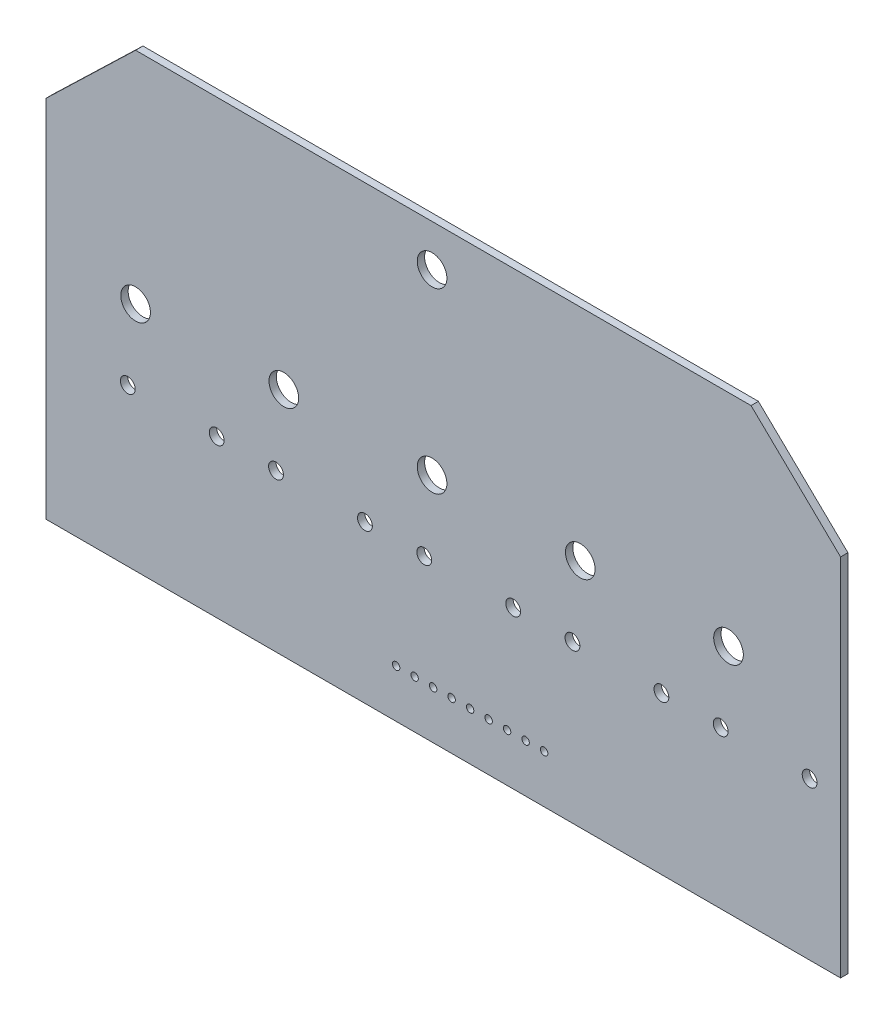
ISO-10303-21;
HEADER;
FILE_DESCRIPTION(('STEP AP214'),'2;1');
FILE_NAME('part.step','',(''),(''),'','','');
FILE_SCHEMA(('AUTOMOTIVE_DESIGN { 1 0 10303 214 1 1 1 1 }'));
ENDSEC;
DATA;
#1=APPLICATION_CONTEXT('core data for automotive mechanical design processes');
#2=APPLICATION_PROTOCOL_DEFINITION('international standard','automotive_design',2000,#1);
#3=PRODUCT_CONTEXT('',#1,'mechanical');
#4=PRODUCT('Part','Part','',(#3));
#5=PRODUCT_RELATED_PRODUCT_CATEGORY('part','',(#4));
#6=PRODUCT_DEFINITION_FORMATION('','',#4);
#7=PRODUCT_DEFINITION_CONTEXT('part definition',#1,'design');
#8=PRODUCT_DEFINITION('design','',#6,#7);
#9=PRODUCT_DEFINITION_SHAPE('','',#8);
#10=(LENGTH_UNIT() NAMED_UNIT(*) SI_UNIT(.MILLI.,.METRE.));
#11=(NAMED_UNIT(*) PLANE_ANGLE_UNIT() SI_UNIT($,.RADIAN.));
#12=(NAMED_UNIT(*) SI_UNIT($,.STERADIAN.) SOLID_ANGLE_UNIT());
#13=UNCERTAINTY_MEASURE_WITH_UNIT(LENGTH_MEASURE(1.E-05),#10,'distance_accuracy_value','');
#14=(GEOMETRIC_REPRESENTATION_CONTEXT(3) GLOBAL_UNCERTAINTY_ASSIGNED_CONTEXT((#13)) GLOBAL_UNIT_ASSIGNED_CONTEXT((#10,
#11,#12)) REPRESENTATION_CONTEXT('',''));
#15=CARTESIAN_POINT('',(0.,0.,0.));
#16=DIRECTION('',(0.,0.,1.));
#17=DIRECTION('',(1.,0.,0.));
#18=AXIS2_PLACEMENT_3D('',#15,#16,#17);
#19=CARTESIAN_POINT('',(65.913,57.5437,1.5748));
#20=DIRECTION('',(-0.694117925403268,-0.719861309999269,0.));
#21=DIRECTION('',(0.719861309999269,-0.694117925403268,0.));
#22=AXIS2_PLACEMENT_3D('',#19,#20,#21);
#23=PLANE('',#22);
#24=DIRECTION('',(-0.719861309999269,0.694117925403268,0.));
#25=VECTOR('',#24,1.);
#26=CARTESIAN_POINT('',(65.913,57.5437,0.));
#27=LINE('',#26,#25);
#28=CARTESIAN_POINT('',(85.09,39.0525,0.));
#29=VERTEX_POINT('',#28);
#30=CARTESIAN_POINT('',(65.913,57.5437,0.));
#31=VERTEX_POINT('',#30);
#32=EDGE_CURVE('E119',#29,#31,#27,.T.);
#33=ORIENTED_EDGE('',*,*,#32,.T.);
#34=DIRECTION('',(0.,0.,-1.));
#35=VECTOR('',#34,1.);
#36=CARTESIAN_POINT('',(65.913,57.5437,1.5748));
#37=LINE('',#36,#35);
#38=CARTESIAN_POINT('',(65.913,57.5437,1.5748));
#39=VERTEX_POINT('',#38);
#40=EDGE_CURVE('E11',#39,#31,#37,.T.);
#41=ORIENTED_EDGE('',*,*,#40,.F.);
#42=DIRECTION('',(-0.719861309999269,0.694117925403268,0.));
#43=VECTOR('',#42,1.);
#44=CARTESIAN_POINT('',(65.913,57.5437,1.5748));
#45=LINE('',#44,#43);
#46=CARTESIAN_POINT('',(85.09,39.0525,1.5748));
#47=VERTEX_POINT('',#46);
#48=EDGE_CURVE('E130',#47,#39,#45,.T.);
#49=ORIENTED_EDGE('',*,*,#48,.F.);
#50=DIRECTION('',(0.,0.,-1.));
#51=VECTOR('',#50,1.);
#52=CARTESIAN_POINT('',(85.09,39.0525,1.5748));
#53=LINE('',#52,#51);
#54=EDGE_CURVE('E115',#47,#29,#53,.T.);
#55=ORIENTED_EDGE('',*,*,#54,.T.);
#56=EDGE_LOOP('',(#33,#41,#49,#55));
#57=FACE_BOUND('',#56,.T.);
#58=ADVANCED_FACE('F33',(#57),#23,.F.);
#59=CARTESIAN_POINT('',(-65.913,57.5437,1.5748));
#60=DIRECTION('',(0.,-1.,0.));
#61=DIRECTION('',(0.,0.,-1.));
#62=AXIS2_PLACEMENT_3D('',#59,#60,#61);
#63=PLANE('',#62);
#64=DIRECTION('',(-1.,0.,0.));
#65=VECTOR('',#64,1.);
#66=CARTESIAN_POINT('',(-65.913,57.5437,0.));
#67=LINE('',#66,#65);
#68=CARTESIAN_POINT('',(-65.913,57.5437,0.));
#69=VERTEX_POINT('',#68);
#70=EDGE_CURVE('E122',#31,#69,#67,.T.);
#71=ORIENTED_EDGE('',*,*,#70,.T.);
#72=DIRECTION('',(0.,0.,-1.));
#73=VECTOR('',#72,1.);
#74=CARTESIAN_POINT('',(-65.913,57.5437,1.5748));
#75=LINE('',#74,#73);
#76=CARTESIAN_POINT('',(-65.913,57.5437,1.5748));
#77=VERTEX_POINT('',#76);
#78=EDGE_CURVE('E42',#77,#69,#75,.T.);
#79=ORIENTED_EDGE('',*,*,#78,.F.);
#80=DIRECTION('',(-1.,0.,0.));
#81=VECTOR('',#80,1.);
#82=CARTESIAN_POINT('',(-65.913,57.5437,1.5748));
#83=LINE('',#82,#81);
#84=EDGE_CURVE('E88',#39,#77,#83,.T.);
#85=ORIENTED_EDGE('',*,*,#84,.F.);
#86=ORIENTED_EDGE('',*,*,#40,.T.);
#87=EDGE_LOOP('',(#71,#79,#85,#86));
#88=FACE_BOUND('',#87,.T.);
#89=ADVANCED_FACE('F175',(#88),#63,.F.);
#90=CARTESIAN_POINT('',(-85.09,39.0525,1.5748));
#91=DIRECTION('',(0.694117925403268,-0.719861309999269,0.));
#92=DIRECTION('',(0.719861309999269,0.694117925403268,0.));
#93=AXIS2_PLACEMENT_3D('',#90,#91,#92);
#94=PLANE('',#93);
#95=DIRECTION('',(-0.719861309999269,-0.694117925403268,0.));
#96=VECTOR('',#95,1.);
#97=CARTESIAN_POINT('',(-85.09,39.0525,0.));
#98=LINE('',#97,#96);
#99=CARTESIAN_POINT('',(-85.09,39.0525,0.));
#100=VERTEX_POINT('',#99);
#101=EDGE_CURVE('E125',#69,#100,#98,.T.);
#102=ORIENTED_EDGE('',*,*,#101,.T.);
#103=DIRECTION('',(0.,0.,-1.));
#104=VECTOR('',#103,1.);
#105=CARTESIAN_POINT('',(-85.09,39.0525,1.5748));
#106=LINE('',#105,#104);
#107=CARTESIAN_POINT('',(-85.09,39.0525,1.5748));
#108=VERTEX_POINT('',#107);
#109=EDGE_CURVE('E110',#108,#100,#106,.T.);
#110=ORIENTED_EDGE('',*,*,#109,.F.);
#111=DIRECTION('',(-0.719861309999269,-0.694117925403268,0.));
#112=VECTOR('',#111,1.);
#113=CARTESIAN_POINT('',(-85.09,39.0525,1.5748));
#114=LINE('',#113,#112);
#115=EDGE_CURVE('E101',#77,#108,#114,.T.);
#116=ORIENTED_EDGE('',*,*,#115,.F.);
#117=ORIENTED_EDGE('',*,*,#78,.T.);
#118=EDGE_LOOP('',(#102,#110,#116,#117));
#119=FACE_BOUND('',#118,.T.);
#120=ADVANCED_FACE('F178',(#119),#94,.F.);
#121=CARTESIAN_POINT('',(-85.09,-39.0525,1.5748));
#122=DIRECTION('',(1.,0.,0.));
#123=DIRECTION('',(0.,0.,-1.));
#124=AXIS2_PLACEMENT_3D('',#121,#122,#123);
#125=PLANE('',#124);
#126=DIRECTION('',(0.,-1.,0.));
#127=VECTOR('',#126,1.);
#128=CARTESIAN_POINT('',(-85.09,-39.0525,0.));
#129=LINE('',#128,#127);
#130=CARTESIAN_POINT('',(-85.09,-39.0525,0.));
#131=VERTEX_POINT('',#130);
#132=EDGE_CURVE('E109',#100,#131,#129,.T.);
#133=ORIENTED_EDGE('',*,*,#132,.T.);
#134=DIRECTION('',(0.,0.,-1.));
#135=VECTOR('',#134,1.);
#136=CARTESIAN_POINT('',(-85.09,-39.0525,1.5748));
#137=LINE('',#136,#135);
#138=CARTESIAN_POINT('',(-85.09,-39.0525,1.5748));
#139=VERTEX_POINT('',#138);
#140=EDGE_CURVE('E106',#139,#131,#137,.T.);
#141=ORIENTED_EDGE('',*,*,#140,.F.);
#142=DIRECTION('',(0.,-1.,0.));
#143=VECTOR('',#142,1.);
#144=CARTESIAN_POINT('',(-85.09,-39.0525,1.5748));
#145=LINE('',#144,#143);
#146=EDGE_CURVE('E95',#108,#139,#145,.T.);
#147=ORIENTED_EDGE('',*,*,#146,.F.);
#148=ORIENTED_EDGE('',*,*,#109,.T.);
#149=EDGE_LOOP('',(#133,#141,#147,#148));
#150=FACE_BOUND('',#149,.T.);
#151=ADVANCED_FACE('F107',(#150),#125,.F.);
#152=CARTESIAN_POINT('',(-85.09,-39.0525,1.5748));
#153=DIRECTION('',(0.,1.,0.));
#154=DIRECTION('',(0.,0.,1.));
#155=AXIS2_PLACEMENT_3D('',#152,#153,#154);
#156=PLANE('',#155);
#157=DIRECTION('',(1.,0.,0.));
#158=VECTOR('',#157,1.);
#159=CARTESIAN_POINT('',(-85.09,-39.0525,0.));
#160=LINE('',#159,#158);
#161=CARTESIAN_POINT('',(85.09,-39.0525,0.));
#162=VERTEX_POINT('',#161);
#163=EDGE_CURVE('E74',#131,#162,#160,.T.);
#164=ORIENTED_EDGE('',*,*,#163,.T.);
#165=DIRECTION('',(0.,0.,-1.));
#166=VECTOR('',#165,1.);
#167=CARTESIAN_POINT('',(85.09,-39.0525,1.5748));
#168=LINE('',#167,#166);
#169=CARTESIAN_POINT('',(85.09,-39.0525,1.5748));
#170=VERTEX_POINT('',#169);
#171=EDGE_CURVE('E111',#170,#162,#168,.T.);
#172=ORIENTED_EDGE('',*,*,#171,.F.);
#173=DIRECTION('',(1.,0.,0.));
#174=VECTOR('',#173,1.);
#175=CARTESIAN_POINT('',(-85.09,-39.0525,1.5748));
#176=LINE('',#175,#174);
#177=EDGE_CURVE('E99',#139,#170,#176,.T.);
#178=ORIENTED_EDGE('',*,*,#177,.F.);
#179=ORIENTED_EDGE('',*,*,#140,.T.);
#180=EDGE_LOOP('',(#164,#172,#178,#179));
#181=FACE_BOUND('',#180,.T.);
#182=ADVANCED_FACE('F113',(#181),#156,.F.);
#183=CARTESIAN_POINT('',(85.09,-39.0525,1.5748));
#184=DIRECTION('',(-1.,0.,0.));
#185=DIRECTION('',(0.,0.,1.));
#186=AXIS2_PLACEMENT_3D('',#183,#184,#185);
#187=PLANE('',#186);
#188=DIRECTION('',(0.,1.,0.));
#189=VECTOR('',#188,1.);
#190=CARTESIAN_POINT('',(85.09,-39.0525,0.));
#191=LINE('',#190,#189);
#192=EDGE_CURVE('E80',#162,#29,#191,.T.);
#193=ORIENTED_EDGE('',*,*,#192,.T.);
#194=ORIENTED_EDGE('',*,*,#54,.F.);
#195=DIRECTION('',(0.,1.,0.));
#196=VECTOR('',#195,1.);
#197=CARTESIAN_POINT('',(85.09,-39.0525,1.5748));
#198=LINE('',#197,#196);
#199=EDGE_CURVE('E51',#170,#47,#198,.T.);
#200=ORIENTED_EDGE('',*,*,#199,.F.);
#201=ORIENTED_EDGE('',*,*,#171,.T.);
#202=EDGE_LOOP('',(#193,#194,#200,#201));
#203=FACE_BOUND('',#202,.T.);
#204=ADVANCED_FACE('F183',(#203),#187,.F.);
#205=CARTESIAN_POINT('',(0.,0.,1.5748));
#206=DIRECTION('',(0.,0.,1.));
#207=DIRECTION('',(1.,0.,0.));
#208=AXIS2_PLACEMENT_3D('',#205,#206,#207);
#209=PLANE('',#208);
#210=CARTESIAN_POINT('',(-10.1092,-28.7655,1.5748));
#211=DIRECTION('',(0.,0.,1.));
#212=DIRECTION('',(1.,0.,0.));
#213=AXIS2_PLACEMENT_3D('',#210,#211,#212);
#214=CIRCLE('',#213,0.793749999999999);
#215=CARTESIAN_POINT('',(-9.31545000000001,-28.7655,1.5748));
#216=VERTEX_POINT('',#215);
#217=EDGE_CURVE('E489',#216,#216,#214,.T.);
#218=ORIENTED_EDGE('',*,*,#217,.F.);
#219=EDGE_LOOP('',(#218));
#220=FACE_BOUND('',#219,.T.);
#221=CARTESIAN_POINT('',(-6.14680000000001,-28.7655,1.5748));
#222=DIRECTION('',(0.,0.,1.));
#223=DIRECTION('',(1.,0.,0.));
#224=AXIS2_PLACEMENT_3D('',#221,#222,#223);
#225=CIRCLE('',#224,0.793749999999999);
#226=CARTESIAN_POINT('',(-5.35305000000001,-28.7655,1.5748));
#227=VERTEX_POINT('',#226);
#228=EDGE_CURVE('E491',#227,#227,#225,.T.);
#229=ORIENTED_EDGE('',*,*,#228,.F.);
#230=EDGE_LOOP('',(#229));
#231=FACE_BOUND('',#230,.T.);
#232=CARTESIAN_POINT('',(-2.18440000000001,-28.7655,1.5748));
#233=DIRECTION('',(0.,0.,1.));
#234=DIRECTION('',(1.,0.,0.));
#235=AXIS2_PLACEMENT_3D('',#232,#233,#234);
#236=CIRCLE('',#235,0.793749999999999);
#237=CARTESIAN_POINT('',(-1.39065000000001,-28.7655,1.5748));
#238=VERTEX_POINT('',#237);
#239=EDGE_CURVE('E497',#238,#238,#236,.T.);
#240=ORIENTED_EDGE('',*,*,#239,.F.);
#241=EDGE_LOOP('',(#240));
#242=FACE_BOUND('',#241,.T.);
#243=CARTESIAN_POINT('',(1.77799999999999,-28.7655,1.5748));
#244=DIRECTION('',(0.,0.,1.));
#245=DIRECTION('',(1.,0.,0.));
#246=AXIS2_PLACEMENT_3D('',#243,#244,#245);
#247=CIRCLE('',#246,0.793749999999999);
#248=CARTESIAN_POINT('',(2.57174999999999,-28.7655,1.5748));
#249=VERTEX_POINT('',#248);
#250=EDGE_CURVE('E503',#249,#249,#247,.T.);
#251=ORIENTED_EDGE('',*,*,#250,.F.);
#252=EDGE_LOOP('',(#251));
#253=FACE_BOUND('',#252,.T.);
#254=CARTESIAN_POINT('',(5.74039999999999,-28.7655,1.5748));
#255=DIRECTION('',(0.,0.,1.));
#256=DIRECTION('',(1.,0.,0.));
#257=AXIS2_PLACEMENT_3D('',#254,#255,#256);
#258=CIRCLE('',#257,0.793749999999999);
#259=CARTESIAN_POINT('',(6.53414999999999,-28.7655,1.5748));
#260=VERTEX_POINT('',#259);
#261=EDGE_CURVE('E509',#260,#260,#258,.T.);
#262=ORIENTED_EDGE('',*,*,#261,.F.);
#263=EDGE_LOOP('',(#262));
#264=FACE_BOUND('',#263,.T.);
#265=CARTESIAN_POINT('',(9.70279999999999,-28.7655,1.5748));
#266=DIRECTION('',(0.,0.,1.));
#267=DIRECTION('',(1.,0.,0.));
#268=AXIS2_PLACEMENT_3D('',#265,#266,#267);
#269=CIRCLE('',#268,0.793749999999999);
#270=CARTESIAN_POINT('',(10.49655,-28.7655,1.5748));
#271=VERTEX_POINT('',#270);
#272=EDGE_CURVE('E515',#271,#271,#269,.T.);
#273=ORIENTED_EDGE('',*,*,#272,.F.);
#274=EDGE_LOOP('',(#273));
#275=FACE_BOUND('',#274,.T.);
#276=CARTESIAN_POINT('',(13.6652,-28.7655,1.5748));
#277=DIRECTION('',(0.,0.,1.));
#278=DIRECTION('',(1.,0.,0.));
#279=AXIS2_PLACEMENT_3D('',#276,#277,#278);
#280=CIRCLE('',#279,0.793749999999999);
#281=CARTESIAN_POINT('',(14.45895,-28.7655,1.5748));
#282=VERTEX_POINT('',#281);
#283=EDGE_CURVE('E521',#282,#282,#280,.T.);
#284=ORIENTED_EDGE('',*,*,#283,.F.);
#285=EDGE_LOOP('',(#284));
#286=FACE_BOUND('',#285,.T.);
#287=CARTESIAN_POINT('',(17.6276,-28.7655,1.5748));
#288=DIRECTION('',(0.,0.,1.));
#289=DIRECTION('',(1.,0.,0.));
#290=AXIS2_PLACEMENT_3D('',#287,#288,#289);
#291=CIRCLE('',#290,0.793749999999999);
#292=CARTESIAN_POINT('',(18.42135,-28.7655,1.5748));
#293=VERTEX_POINT('',#292);
#294=EDGE_CURVE('E527',#293,#293,#291,.T.);
#295=ORIENTED_EDGE('',*,*,#294,.F.);
#296=EDGE_LOOP('',(#295));
#297=FACE_BOUND('',#296,.T.);
#298=CARTESIAN_POINT('',(21.59,-28.7655,1.5748));
#299=DIRECTION('',(0.,0.,1.));
#300=DIRECTION('',(1.,0.,0.));
#301=AXIS2_PLACEMENT_3D('',#298,#299,#300);
#302=CIRCLE('',#301,0.793749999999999);
#303=CARTESIAN_POINT('',(22.38375,-28.7655,1.5748));
#304=VERTEX_POINT('',#303);
#305=EDGE_CURVE('E533',#304,#304,#302,.T.);
#306=ORIENTED_EDGE('',*,*,#305,.F.);
#307=EDGE_LOOP('',(#306));
#308=FACE_BOUND('',#307,.T.);
#309=CARTESIAN_POINT('',(-67.5894,-5.39750000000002,1.5748));
#310=DIRECTION('',(0.,0.,1.));
#311=DIRECTION('',(1.,0.,0.));
#312=AXIS2_PLACEMENT_3D('',#309,#310,#311);
#313=CIRCLE('',#312,1.5875);
#314=CARTESIAN_POINT('',(-66.0019,-5.39750000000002,1.5748));
#315=VERTEX_POINT('',#314);
#316=EDGE_CURVE('E539',#315,#315,#313,.T.);
#317=ORIENTED_EDGE('',*,*,#316,.F.);
#318=EDGE_LOOP('',(#317));
#319=FACE_BOUND('',#318,.T.);
#320=CARTESIAN_POINT('',(-48.5394,-5.39750000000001,1.5748));
#321=DIRECTION('',(0.,0.,1.));
#322=DIRECTION('',(1.,0.,0.));
#323=AXIS2_PLACEMENT_3D('',#320,#321,#322);
#324=CIRCLE('',#323,1.5875);
#325=CARTESIAN_POINT('',(-46.9519,-5.39750000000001,1.5748));
#326=VERTEX_POINT('',#325);
#327=EDGE_CURVE('E545',#326,#326,#324,.T.);
#328=ORIENTED_EDGE('',*,*,#327,.F.);
#329=EDGE_LOOP('',(#328));
#330=FACE_BOUND('',#329,.T.);
#331=CARTESIAN_POINT('',(-35.8394,-5.39750000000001,1.5748));
#332=DIRECTION('',(0.,0.,1.));
#333=DIRECTION('',(1.,0.,0.));
#334=AXIS2_PLACEMENT_3D('',#331,#332,#333);
#335=CIRCLE('',#334,1.5875);
#336=CARTESIAN_POINT('',(-34.2519,-5.39750000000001,1.5748));
#337=VERTEX_POINT('',#336);
#338=EDGE_CURVE('E551',#337,#337,#335,.T.);
#339=ORIENTED_EDGE('',*,*,#338,.F.);
#340=EDGE_LOOP('',(#339));
#341=FACE_BOUND('',#340,.T.);
#342=CARTESIAN_POINT('',(-16.7894,-5.39750000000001,1.5748));
#343=DIRECTION('',(0.,0.,1.));
#344=DIRECTION('',(1.,0.,0.));
#345=AXIS2_PLACEMENT_3D('',#342,#343,#344);
#346=CIRCLE('',#345,1.5875);
#347=CARTESIAN_POINT('',(-15.2019,-5.39750000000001,1.5748));
#348=VERTEX_POINT('',#347);
#349=EDGE_CURVE('E557',#348,#348,#346,.T.);
#350=ORIENTED_EDGE('',*,*,#349,.F.);
#351=EDGE_LOOP('',(#350));
#352=FACE_BOUND('',#351,.T.);
#353=CARTESIAN_POINT('',(-4.08940000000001,-5.39750000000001,1.5748));
#354=DIRECTION('',(0.,0.,1.));
#355=DIRECTION('',(1.,0.,0.));
#356=AXIS2_PLACEMENT_3D('',#353,#354,#355);
#357=CIRCLE('',#356,1.5875);
#358=CARTESIAN_POINT('',(-2.50190000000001,-5.39750000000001,1.5748));
#359=VERTEX_POINT('',#358);
#360=EDGE_CURVE('E563',#359,#359,#357,.T.);
#361=ORIENTED_EDGE('',*,*,#360,.F.);
#362=EDGE_LOOP('',(#361));
#363=FACE_BOUND('',#362,.T.);
#364=CARTESIAN_POINT('',(14.9606,-5.3975,1.5748));
#365=DIRECTION('',(0.,0.,1.));
#366=DIRECTION('',(1.,0.,0.));
#367=AXIS2_PLACEMENT_3D('',#364,#365,#366);
#368=CIRCLE('',#367,1.5875);
#369=CARTESIAN_POINT('',(16.5481,-5.3975,1.5748));
#370=VERTEX_POINT('',#369);
#371=EDGE_CURVE('E569',#370,#370,#368,.T.);
#372=ORIENTED_EDGE('',*,*,#371,.F.);
#373=EDGE_LOOP('',(#372));
#374=FACE_BOUND('',#373,.T.);
#375=CARTESIAN_POINT('',(27.6606,-5.3975,1.5748));
#376=DIRECTION('',(0.,0.,1.));
#377=DIRECTION('',(1.,0.,0.));
#378=AXIS2_PLACEMENT_3D('',#375,#376,#377);
#379=CIRCLE('',#378,1.5875);
#380=CARTESIAN_POINT('',(29.2481,-5.3975,1.5748));
#381=VERTEX_POINT('',#380);
#382=EDGE_CURVE('E575',#381,#381,#379,.T.);
#383=ORIENTED_EDGE('',*,*,#382,.F.);
#384=EDGE_LOOP('',(#383));
#385=FACE_BOUND('',#384,.T.);
#386=CARTESIAN_POINT('',(46.7106,-5.3975,1.5748));
#387=DIRECTION('',(0.,0.,1.));
#388=DIRECTION('',(1.,0.,0.));
#389=AXIS2_PLACEMENT_3D('',#386,#387,#388);
#390=CIRCLE('',#389,1.5875);
#391=CARTESIAN_POINT('',(48.2981,-5.3975,1.5748));
#392=VERTEX_POINT('',#391);
#393=EDGE_CURVE('E581',#392,#392,#390,.T.);
#394=ORIENTED_EDGE('',*,*,#393,.F.);
#395=EDGE_LOOP('',(#394));
#396=FACE_BOUND('',#395,.T.);
#397=CARTESIAN_POINT('',(59.4106,-5.3975,1.5748));
#398=DIRECTION('',(0.,0.,1.));
#399=DIRECTION('',(1.,0.,0.));
#400=AXIS2_PLACEMENT_3D('',#397,#398,#399);
#401=CIRCLE('',#400,1.5875);
#402=CARTESIAN_POINT('',(60.9981,-5.3975,1.5748));
#403=VERTEX_POINT('',#402);
#404=EDGE_CURVE('E587',#403,#403,#401,.T.);
#405=ORIENTED_EDGE('',*,*,#404,.F.);
#406=EDGE_LOOP('',(#405));
#407=FACE_BOUND('',#406,.T.);
#408=CARTESIAN_POINT('',(78.4606,-5.3975,1.5748));
#409=DIRECTION('',(0.,0.,1.));
#410=DIRECTION('',(1.,0.,0.));
#411=AXIS2_PLACEMENT_3D('',#408,#409,#410);
#412=CIRCLE('',#411,1.5875);
#413=CARTESIAN_POINT('',(80.0481,-5.3975,1.5748));
#414=VERTEX_POINT('',#413);
#415=EDGE_CURVE('E593',#414,#414,#412,.T.);
#416=ORIENTED_EDGE('',*,*,#415,.F.);
#417=EDGE_LOOP('',(#416));
#418=FACE_BOUND('',#417,.T.);
#419=CARTESIAN_POINT('',(-2.41300000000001,48.5775,1.5748));
#420=DIRECTION('',(0.,0.,1.));
#421=DIRECTION('',(1.,0.,0.));
#422=AXIS2_PLACEMENT_3D('',#419,#420,#421);
#423=CIRCLE('',#422,3.175);
#424=CARTESIAN_POINT('',(0.761999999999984,48.5775,1.5748));
#425=VERTEX_POINT('',#424);
#426=EDGE_CURVE('E162',#425,#425,#423,.T.);
#427=ORIENTED_EDGE('',*,*,#426,.F.);
#428=EDGE_LOOP('',(#427));
#429=FACE_BOUND('',#428,.T.);
#430=CARTESIAN_POINT('',(-2.41300000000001,10.4775,1.5748));
#431=DIRECTION('',(0.,0.,1.));
#432=DIRECTION('',(1.,0.,0.));
#433=AXIS2_PLACEMENT_3D('',#430,#431,#432);
#434=CIRCLE('',#433,3.175);
#435=CARTESIAN_POINT('',(0.761999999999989,10.4775,1.5748));
#436=VERTEX_POINT('',#435);
#437=EDGE_CURVE('E152',#436,#436,#434,.T.);
#438=ORIENTED_EDGE('',*,*,#437,.F.);
#439=EDGE_LOOP('',(#438));
#440=FACE_BOUND('',#439,.T.);
#441=CARTESIAN_POINT('',(29.337,10.4775,1.5748));
#442=DIRECTION('',(0.,0.,1.));
#443=DIRECTION('',(1.,0.,0.));
#444=AXIS2_PLACEMENT_3D('',#441,#442,#443);
#445=CIRCLE('',#444,3.175);
#446=CARTESIAN_POINT('',(32.512,10.4775,1.5748));
#447=VERTEX_POINT('',#446);
#448=EDGE_CURVE('E149',#447,#447,#445,.T.);
#449=ORIENTED_EDGE('',*,*,#448,.F.);
#450=EDGE_LOOP('',(#449));
#451=FACE_BOUND('',#450,.T.);
#452=CARTESIAN_POINT('',(-34.163,10.4775,1.5748));
#453=DIRECTION('',(0.,0.,1.));
#454=DIRECTION('',(1.,0.,0.));
#455=AXIS2_PLACEMENT_3D('',#452,#453,#454);
#456=CIRCLE('',#455,3.175);
#457=CARTESIAN_POINT('',(-30.988,10.4775,1.5748));
#458=VERTEX_POINT('',#457);
#459=EDGE_CURVE('E146',#458,#458,#456,.T.);
#460=ORIENTED_EDGE('',*,*,#459,.F.);
#461=EDGE_LOOP('',(#460));
#462=FACE_BOUND('',#461,.T.);
#463=CARTESIAN_POINT('',(61.087,10.4775,1.5748));
#464=DIRECTION('',(0.,0.,1.));
#465=DIRECTION('',(1.,0.,0.));
#466=AXIS2_PLACEMENT_3D('',#463,#464,#465);
#467=CIRCLE('',#466,3.175);
#468=CARTESIAN_POINT('',(64.262,10.4775,1.5748));
#469=VERTEX_POINT('',#468);
#470=EDGE_CURVE('E142',#469,#469,#467,.T.);
#471=ORIENTED_EDGE('',*,*,#470,.F.);
#472=EDGE_LOOP('',(#471));
#473=FACE_BOUND('',#472,.T.);
#474=CARTESIAN_POINT('',(-65.913,10.4775,1.5748));
#475=DIRECTION('',(0.,0.,1.));
#476=DIRECTION('',(1.,0.,0.));
#477=AXIS2_PLACEMENT_3D('',#474,#475,#476);
#478=CIRCLE('',#477,3.175);
#479=CARTESIAN_POINT('',(-62.738,10.4775,1.5748));
#480=VERTEX_POINT('',#479);
#481=EDGE_CURVE('E138',#480,#480,#478,.T.);
#482=ORIENTED_EDGE('',*,*,#481,.F.);
#483=EDGE_LOOP('',(#482));
#484=FACE_BOUND('',#483,.T.);
#485=ORIENTED_EDGE('',*,*,#48,.T.);
#486=ORIENTED_EDGE('',*,*,#84,.T.);
#487=ORIENTED_EDGE('',*,*,#115,.T.);
#488=ORIENTED_EDGE('',*,*,#146,.T.);
#489=ORIENTED_EDGE('',*,*,#177,.T.);
#490=ORIENTED_EDGE('',*,*,#199,.T.);
#491=EDGE_LOOP('',(#485,#486,#487,#488,#489,#490));
#492=FACE_BOUND('',#491,.T.);
#493=ADVANCED_FACE('F97',(#220,#231,#242,#253,#264,#275,#286,#297,#308,#319,#330,#341,#352,#363,
#374,#385,#396,#407,#418,#429,#440,#451,#462,#473,#484,#492),#209,.T.);
#494=CARTESIAN_POINT('',(0.,0.,0.));
#495=DIRECTION('',(0.,0.,1.));
#496=DIRECTION('',(1.,0.,0.));
#497=AXIS2_PLACEMENT_3D('',#494,#495,#496);
#498=PLANE('',#497);
#499=CARTESIAN_POINT('',(-10.1092,-28.7655,0.));
#500=DIRECTION('',(0.,0.,1.));
#501=DIRECTION('',(1.,0.,0.));
#502=AXIS2_PLACEMENT_3D('',#499,#500,#501);
#503=CIRCLE('',#502,0.793749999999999);
#504=CARTESIAN_POINT('',(-9.31545000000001,-28.7655,0.));
#505=VERTEX_POINT('',#504);
#506=EDGE_CURVE('E486',#505,#505,#503,.T.);
#507=ORIENTED_EDGE('',*,*,#506,.T.);
#508=EDGE_LOOP('',(#507));
#509=FACE_BOUND('',#508,.T.);
#510=CARTESIAN_POINT('',(-6.14680000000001,-28.7655,0.));
#511=DIRECTION('',(0.,0.,1.));
#512=DIRECTION('',(1.,0.,0.));
#513=AXIS2_PLACEMENT_3D('',#510,#511,#512);
#514=CIRCLE('',#513,0.793749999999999);
#515=CARTESIAN_POINT('',(-5.35305000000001,-28.7655,0.));
#516=VERTEX_POINT('',#515);
#517=EDGE_CURVE('E494',#516,#516,#514,.T.);
#518=ORIENTED_EDGE('',*,*,#517,.T.);
#519=EDGE_LOOP('',(#518));
#520=FACE_BOUND('',#519,.T.);
#521=CARTESIAN_POINT('',(-2.18440000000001,-28.7655,0.));
#522=DIRECTION('',(0.,0.,1.));
#523=DIRECTION('',(1.,0.,0.));
#524=AXIS2_PLACEMENT_3D('',#521,#522,#523);
#525=CIRCLE('',#524,0.793749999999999);
#526=CARTESIAN_POINT('',(-1.39065000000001,-28.7655,0.));
#527=VERTEX_POINT('',#526);
#528=EDGE_CURVE('E500',#527,#527,#525,.T.);
#529=ORIENTED_EDGE('',*,*,#528,.T.);
#530=EDGE_LOOP('',(#529));
#531=FACE_BOUND('',#530,.T.);
#532=CARTESIAN_POINT('',(1.77799999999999,-28.7655,0.));
#533=DIRECTION('',(0.,0.,1.));
#534=DIRECTION('',(1.,0.,0.));
#535=AXIS2_PLACEMENT_3D('',#532,#533,#534);
#536=CIRCLE('',#535,0.793749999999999);
#537=CARTESIAN_POINT('',(2.57174999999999,-28.7655,0.));
#538=VERTEX_POINT('',#537);
#539=EDGE_CURVE('E506',#538,#538,#536,.T.);
#540=ORIENTED_EDGE('',*,*,#539,.T.);
#541=EDGE_LOOP('',(#540));
#542=FACE_BOUND('',#541,.T.);
#543=CARTESIAN_POINT('',(5.74039999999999,-28.7655,0.));
#544=DIRECTION('',(0.,0.,1.));
#545=DIRECTION('',(1.,0.,0.));
#546=AXIS2_PLACEMENT_3D('',#543,#544,#545);
#547=CIRCLE('',#546,0.793749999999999);
#548=CARTESIAN_POINT('',(6.53414999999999,-28.7655,0.));
#549=VERTEX_POINT('',#548);
#550=EDGE_CURVE('E512',#549,#549,#547,.T.);
#551=ORIENTED_EDGE('',*,*,#550,.T.);
#552=EDGE_LOOP('',(#551));
#553=FACE_BOUND('',#552,.T.);
#554=CARTESIAN_POINT('',(9.70279999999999,-28.7655,0.));
#555=DIRECTION('',(0.,0.,1.));
#556=DIRECTION('',(1.,0.,0.));
#557=AXIS2_PLACEMENT_3D('',#554,#555,#556);
#558=CIRCLE('',#557,0.793749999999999);
#559=CARTESIAN_POINT('',(10.49655,-28.7655,0.));
#560=VERTEX_POINT('',#559);
#561=EDGE_CURVE('E518',#560,#560,#558,.T.);
#562=ORIENTED_EDGE('',*,*,#561,.T.);
#563=EDGE_LOOP('',(#562));
#564=FACE_BOUND('',#563,.T.);
#565=CARTESIAN_POINT('',(13.6652,-28.7655,0.));
#566=DIRECTION('',(0.,0.,1.));
#567=DIRECTION('',(1.,0.,0.));
#568=AXIS2_PLACEMENT_3D('',#565,#566,#567);
#569=CIRCLE('',#568,0.793749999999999);
#570=CARTESIAN_POINT('',(14.45895,-28.7655,0.));
#571=VERTEX_POINT('',#570);
#572=EDGE_CURVE('E524',#571,#571,#569,.T.);
#573=ORIENTED_EDGE('',*,*,#572,.T.);
#574=EDGE_LOOP('',(#573));
#575=FACE_BOUND('',#574,.T.);
#576=CARTESIAN_POINT('',(17.6276,-28.7655,0.));
#577=DIRECTION('',(0.,0.,1.));
#578=DIRECTION('',(1.,0.,0.));
#579=AXIS2_PLACEMENT_3D('',#576,#577,#578);
#580=CIRCLE('',#579,0.793749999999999);
#581=CARTESIAN_POINT('',(18.42135,-28.7655,0.));
#582=VERTEX_POINT('',#581);
#583=EDGE_CURVE('E530',#582,#582,#580,.T.);
#584=ORIENTED_EDGE('',*,*,#583,.T.);
#585=EDGE_LOOP('',(#584));
#586=FACE_BOUND('',#585,.T.);
#587=CARTESIAN_POINT('',(21.59,-28.7655,0.));
#588=DIRECTION('',(0.,0.,1.));
#589=DIRECTION('',(1.,0.,0.));
#590=AXIS2_PLACEMENT_3D('',#587,#588,#589);
#591=CIRCLE('',#590,0.793749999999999);
#592=CARTESIAN_POINT('',(22.38375,-28.7655,0.));
#593=VERTEX_POINT('',#592);
#594=EDGE_CURVE('E536',#593,#593,#591,.T.);
#595=ORIENTED_EDGE('',*,*,#594,.T.);
#596=EDGE_LOOP('',(#595));
#597=FACE_BOUND('',#596,.T.);
#598=CARTESIAN_POINT('',(-67.5894,-5.39750000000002,0.));
#599=DIRECTION('',(0.,0.,1.));
#600=DIRECTION('',(1.,0.,0.));
#601=AXIS2_PLACEMENT_3D('',#598,#599,#600);
#602=CIRCLE('',#601,1.5875);
#603=CARTESIAN_POINT('',(-66.0019,-5.39750000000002,0.));
#604=VERTEX_POINT('',#603);
#605=EDGE_CURVE('E542',#604,#604,#602,.T.);
#606=ORIENTED_EDGE('',*,*,#605,.T.);
#607=EDGE_LOOP('',(#606));
#608=FACE_BOUND('',#607,.T.);
#609=CARTESIAN_POINT('',(-48.5394,-5.39750000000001,0.));
#610=DIRECTION('',(0.,0.,1.));
#611=DIRECTION('',(1.,0.,0.));
#612=AXIS2_PLACEMENT_3D('',#609,#610,#611);
#613=CIRCLE('',#612,1.5875);
#614=CARTESIAN_POINT('',(-46.9519,-5.39750000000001,0.));
#615=VERTEX_POINT('',#614);
#616=EDGE_CURVE('E548',#615,#615,#613,.T.);
#617=ORIENTED_EDGE('',*,*,#616,.T.);
#618=EDGE_LOOP('',(#617));
#619=FACE_BOUND('',#618,.T.);
#620=CARTESIAN_POINT('',(-35.8394,-5.39750000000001,0.));
#621=DIRECTION('',(0.,0.,1.));
#622=DIRECTION('',(1.,0.,0.));
#623=AXIS2_PLACEMENT_3D('',#620,#621,#622);
#624=CIRCLE('',#623,1.5875);
#625=CARTESIAN_POINT('',(-34.2519,-5.39750000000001,0.));
#626=VERTEX_POINT('',#625);
#627=EDGE_CURVE('E554',#626,#626,#624,.T.);
#628=ORIENTED_EDGE('',*,*,#627,.T.);
#629=EDGE_LOOP('',(#628));
#630=FACE_BOUND('',#629,.T.);
#631=CARTESIAN_POINT('',(-16.7894,-5.39750000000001,0.));
#632=DIRECTION('',(0.,0.,1.));
#633=DIRECTION('',(1.,0.,0.));
#634=AXIS2_PLACEMENT_3D('',#631,#632,#633);
#635=CIRCLE('',#634,1.5875);
#636=CARTESIAN_POINT('',(-15.2019,-5.39750000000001,0.));
#637=VERTEX_POINT('',#636);
#638=EDGE_CURVE('E560',#637,#637,#635,.T.);
#639=ORIENTED_EDGE('',*,*,#638,.T.);
#640=EDGE_LOOP('',(#639));
#641=FACE_BOUND('',#640,.T.);
#642=CARTESIAN_POINT('',(-4.08940000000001,-5.39750000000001,0.));
#643=DIRECTION('',(0.,0.,1.));
#644=DIRECTION('',(1.,0.,0.));
#645=AXIS2_PLACEMENT_3D('',#642,#643,#644);
#646=CIRCLE('',#645,1.5875);
#647=CARTESIAN_POINT('',(-2.50190000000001,-5.39750000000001,0.));
#648=VERTEX_POINT('',#647);
#649=EDGE_CURVE('E566',#648,#648,#646,.T.);
#650=ORIENTED_EDGE('',*,*,#649,.T.);
#651=EDGE_LOOP('',(#650));
#652=FACE_BOUND('',#651,.T.);
#653=CARTESIAN_POINT('',(14.9606,-5.3975,0.));
#654=DIRECTION('',(0.,0.,1.));
#655=DIRECTION('',(1.,0.,0.));
#656=AXIS2_PLACEMENT_3D('',#653,#654,#655);
#657=CIRCLE('',#656,1.5875);
#658=CARTESIAN_POINT('',(16.5481,-5.3975,0.));
#659=VERTEX_POINT('',#658);
#660=EDGE_CURVE('E572',#659,#659,#657,.T.);
#661=ORIENTED_EDGE('',*,*,#660,.T.);
#662=EDGE_LOOP('',(#661));
#663=FACE_BOUND('',#662,.T.);
#664=CARTESIAN_POINT('',(27.6606,-5.3975,0.));
#665=DIRECTION('',(0.,0.,1.));
#666=DIRECTION('',(1.,0.,0.));
#667=AXIS2_PLACEMENT_3D('',#664,#665,#666);
#668=CIRCLE('',#667,1.5875);
#669=CARTESIAN_POINT('',(29.2481,-5.3975,0.));
#670=VERTEX_POINT('',#669);
#671=EDGE_CURVE('E578',#670,#670,#668,.T.);
#672=ORIENTED_EDGE('',*,*,#671,.T.);
#673=EDGE_LOOP('',(#672));
#674=FACE_BOUND('',#673,.T.);
#675=CARTESIAN_POINT('',(46.7106,-5.3975,0.));
#676=DIRECTION('',(0.,0.,1.));
#677=DIRECTION('',(1.,0.,0.));
#678=AXIS2_PLACEMENT_3D('',#675,#676,#677);
#679=CIRCLE('',#678,1.5875);
#680=CARTESIAN_POINT('',(48.2981,-5.3975,0.));
#681=VERTEX_POINT('',#680);
#682=EDGE_CURVE('E584',#681,#681,#679,.T.);
#683=ORIENTED_EDGE('',*,*,#682,.T.);
#684=EDGE_LOOP('',(#683));
#685=FACE_BOUND('',#684,.T.);
#686=CARTESIAN_POINT('',(59.4106,-5.3975,0.));
#687=DIRECTION('',(0.,0.,1.));
#688=DIRECTION('',(1.,0.,0.));
#689=AXIS2_PLACEMENT_3D('',#686,#687,#688);
#690=CIRCLE('',#689,1.5875);
#691=CARTESIAN_POINT('',(60.9981,-5.3975,0.));
#692=VERTEX_POINT('',#691);
#693=EDGE_CURVE('E590',#692,#692,#690,.T.);
#694=ORIENTED_EDGE('',*,*,#693,.T.);
#695=EDGE_LOOP('',(#694));
#696=FACE_BOUND('',#695,.T.);
#697=CARTESIAN_POINT('',(78.4606,-5.3975,0.));
#698=DIRECTION('',(0.,0.,1.));
#699=DIRECTION('',(1.,0.,0.));
#700=AXIS2_PLACEMENT_3D('',#697,#698,#699);
#701=CIRCLE('',#700,1.5875);
#702=CARTESIAN_POINT('',(80.0481,-5.3975,0.));
#703=VERTEX_POINT('',#702);
#704=EDGE_CURVE('E596',#703,#703,#701,.T.);
#705=ORIENTED_EDGE('',*,*,#704,.T.);
#706=EDGE_LOOP('',(#705));
#707=FACE_BOUND('',#706,.T.);
#708=CARTESIAN_POINT('',(-2.41300000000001,48.5775,0.));
#709=DIRECTION('',(0.,0.,1.));
#710=DIRECTION('',(1.,0.,0.));
#711=AXIS2_PLACEMENT_3D('',#708,#709,#710);
#712=CIRCLE('',#711,3.175);
#713=CARTESIAN_POINT('',(0.761999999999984,48.5775,0.));
#714=VERTEX_POINT('',#713);
#715=EDGE_CURVE('E36',#714,#714,#712,.T.);
#716=ORIENTED_EDGE('',*,*,#715,.T.);
#717=EDGE_LOOP('',(#716));
#718=FACE_BOUND('',#717,.T.);
#719=CARTESIAN_POINT('',(-2.41300000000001,10.4775,0.));
#720=DIRECTION('',(0.,0.,1.));
#721=DIRECTION('',(1.,0.,0.));
#722=AXIS2_PLACEMENT_3D('',#719,#720,#721);
#723=CIRCLE('',#722,3.175);
#724=CARTESIAN_POINT('',(0.761999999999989,10.4775,0.));
#725=VERTEX_POINT('',#724);
#726=EDGE_CURVE('E150',#725,#725,#723,.T.);
#727=ORIENTED_EDGE('',*,*,#726,.T.);
#728=EDGE_LOOP('',(#727));
#729=FACE_BOUND('',#728,.T.);
#730=CARTESIAN_POINT('',(29.337,10.4775,0.));
#731=DIRECTION('',(0.,0.,1.));
#732=DIRECTION('',(1.,0.,0.));
#733=AXIS2_PLACEMENT_3D('',#730,#731,#732);
#734=CIRCLE('',#733,3.175);
#735=CARTESIAN_POINT('',(32.512,10.4775,0.));
#736=VERTEX_POINT('',#735);
#737=EDGE_CURVE('E147',#736,#736,#734,.T.);
#738=ORIENTED_EDGE('',*,*,#737,.T.);
#739=EDGE_LOOP('',(#738));
#740=FACE_BOUND('',#739,.T.);
#741=CARTESIAN_POINT('',(-34.163,10.4775,0.));
#742=DIRECTION('',(0.,0.,1.));
#743=DIRECTION('',(1.,0.,0.));
#744=AXIS2_PLACEMENT_3D('',#741,#742,#743);
#745=CIRCLE('',#744,3.175);
#746=CARTESIAN_POINT('',(-30.988,10.4775,0.));
#747=VERTEX_POINT('',#746);
#748=EDGE_CURVE('E143',#747,#747,#745,.T.);
#749=ORIENTED_EDGE('',*,*,#748,.T.);
#750=EDGE_LOOP('',(#749));
#751=FACE_BOUND('',#750,.T.);
#752=CARTESIAN_POINT('',(61.087,10.4775,0.));
#753=DIRECTION('',(0.,0.,1.));
#754=DIRECTION('',(1.,0.,0.));
#755=AXIS2_PLACEMENT_3D('',#752,#753,#754);
#756=CIRCLE('',#755,3.175);
#757=CARTESIAN_POINT('',(64.262,10.4775,0.));
#758=VERTEX_POINT('',#757);
#759=EDGE_CURVE('E139',#758,#758,#756,.T.);
#760=ORIENTED_EDGE('',*,*,#759,.T.);
#761=EDGE_LOOP('',(#760));
#762=FACE_BOUND('',#761,.T.);
#763=CARTESIAN_POINT('',(-65.913,10.4775,0.));
#764=DIRECTION('',(0.,0.,1.));
#765=DIRECTION('',(1.,0.,0.));
#766=AXIS2_PLACEMENT_3D('',#763,#764,#765);
#767=CIRCLE('',#766,3.175);
#768=CARTESIAN_POINT('',(-62.738,10.4775,0.));
#769=VERTEX_POINT('',#768);
#770=EDGE_CURVE('E123',#769,#769,#767,.T.);
#771=ORIENTED_EDGE('',*,*,#770,.T.);
#772=EDGE_LOOP('',(#771));
#773=FACE_BOUND('',#772,.T.);
#774=ORIENTED_EDGE('',*,*,#32,.F.);
#775=ORIENTED_EDGE('',*,*,#192,.F.);
#776=ORIENTED_EDGE('',*,*,#163,.F.);
#777=ORIENTED_EDGE('',*,*,#132,.F.);
#778=ORIENTED_EDGE('',*,*,#101,.F.);
#779=ORIENTED_EDGE('',*,*,#70,.F.);
#780=EDGE_LOOP('',(#774,#775,#776,#777,#778,#779));
#781=FACE_BOUND('',#780,.T.);
#782=ADVANCED_FACE('F181',(#509,#520,#531,#542,#553,#564,#575,#586,#597,#608,#619,#630,#641,
#652,#663,#674,#685,#696,#707,#718,#729,#740,#751,#762,#773,#781),#498,.F.);
#783=CARTESIAN_POINT('',(-65.913,10.4775,-2.54));
#784=DIRECTION('',(0.,0.,1.));
#785=DIRECTION('',(1.,0.,0.));
#786=AXIS2_PLACEMENT_3D('',#783,#784,#785);
#787=CYLINDRICAL_SURFACE('',#786,3.175);
#788=ORIENTED_EDGE('',*,*,#481,.T.);
#789=EDGE_LOOP('',(#788));
#790=FACE_BOUND('',#789,.T.);
#791=ORIENTED_EDGE('',*,*,#770,.F.);
#792=EDGE_LOOP('',(#791));
#793=FACE_BOUND('',#792,.T.);
#794=ADVANCED_FACE('F222',(#790,#793),#787,.F.);
#795=CARTESIAN_POINT('',(61.087,10.4775,-2.54));
#796=DIRECTION('',(0.,0.,1.));
#797=DIRECTION('',(1.,0.,0.));
#798=AXIS2_PLACEMENT_3D('',#795,#796,#797);
#799=CYLINDRICAL_SURFACE('',#798,3.175);
#800=ORIENTED_EDGE('',*,*,#470,.T.);
#801=EDGE_LOOP('',(#800));
#802=FACE_BOUND('',#801,.T.);
#803=ORIENTED_EDGE('',*,*,#759,.F.);
#804=EDGE_LOOP('',(#803));
#805=FACE_BOUND('',#804,.T.);
#806=ADVANCED_FACE('F227',(#802,#805),#799,.F.);
#807=CARTESIAN_POINT('',(-34.163,10.4775,-2.54));
#808=DIRECTION('',(0.,0.,1.));
#809=DIRECTION('',(1.,0.,0.));
#810=AXIS2_PLACEMENT_3D('',#807,#808,#809);
#811=CYLINDRICAL_SURFACE('',#810,3.175);
#812=ORIENTED_EDGE('',*,*,#459,.T.);
#813=EDGE_LOOP('',(#812));
#814=FACE_BOUND('',#813,.T.);
#815=ORIENTED_EDGE('',*,*,#748,.F.);
#816=EDGE_LOOP('',(#815));
#817=FACE_BOUND('',#816,.T.);
#818=ADVANCED_FACE('F239',(#814,#817),#811,.F.);
#819=CARTESIAN_POINT('',(29.337,10.4775,-2.54));
#820=DIRECTION('',(0.,0.,1.));
#821=DIRECTION('',(1.,0.,0.));
#822=AXIS2_PLACEMENT_3D('',#819,#820,#821);
#823=CYLINDRICAL_SURFACE('',#822,3.175);
#824=ORIENTED_EDGE('',*,*,#448,.T.);
#825=EDGE_LOOP('',(#824));
#826=FACE_BOUND('',#825,.T.);
#827=ORIENTED_EDGE('',*,*,#737,.F.);
#828=EDGE_LOOP('',(#827));
#829=FACE_BOUND('',#828,.T.);
#830=ADVANCED_FACE('F249',(#826,#829),#823,.F.);
#831=CARTESIAN_POINT('',(-2.41300000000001,10.4775,-2.54));
#832=DIRECTION('',(0.,0.,1.));
#833=DIRECTION('',(1.,0.,0.));
#834=AXIS2_PLACEMENT_3D('',#831,#832,#833);
#835=CYLINDRICAL_SURFACE('',#834,3.175);
#836=ORIENTED_EDGE('',*,*,#437,.T.);
#837=EDGE_LOOP('',(#836));
#838=FACE_BOUND('',#837,.T.);
#839=ORIENTED_EDGE('',*,*,#726,.F.);
#840=EDGE_LOOP('',(#839));
#841=FACE_BOUND('',#840,.T.);
#842=ADVANCED_FACE('F259',(#838,#841),#835,.F.);
#843=CARTESIAN_POINT('',(-2.41300000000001,48.5775,-2.54));
#844=DIRECTION('',(0.,0.,1.));
#845=DIRECTION('',(1.,0.,0.));
#846=AXIS2_PLACEMENT_3D('',#843,#844,#845);
#847=CYLINDRICAL_SURFACE('',#846,3.175);
#848=ORIENTED_EDGE('',*,*,#426,.T.);
#849=EDGE_LOOP('',(#848));
#850=FACE_BOUND('',#849,.T.);
#851=ORIENTED_EDGE('',*,*,#715,.F.);
#852=EDGE_LOOP('',(#851));
#853=FACE_BOUND('',#852,.T.);
#854=ADVANCED_FACE('F269',(#850,#853),#847,.F.);
#855=CARTESIAN_POINT('',(78.4606,-5.3975,0.));
#856=DIRECTION('',(0.,0.,1.));
#857=DIRECTION('',(1.,0.,0.));
#858=AXIS2_PLACEMENT_3D('',#855,#856,#857);
#859=CYLINDRICAL_SURFACE('',#858,1.5875);
#860=ORIENTED_EDGE('',*,*,#704,.F.);
#861=EDGE_LOOP('',(#860));
#862=FACE_BOUND('',#861,.T.);
#863=ORIENTED_EDGE('',*,*,#415,.T.);
#864=EDGE_LOOP('',(#863));
#865=FACE_BOUND('',#864,.T.);
#866=ADVANCED_FACE('F278',(#862,#865),#859,.F.);
#867=CARTESIAN_POINT('',(59.4106,-5.3975,0.));
#868=DIRECTION('',(0.,0.,1.));
#869=DIRECTION('',(1.,0.,0.));
#870=AXIS2_PLACEMENT_3D('',#867,#868,#869);
#871=CYLINDRICAL_SURFACE('',#870,1.5875);
#872=ORIENTED_EDGE('',*,*,#693,.F.);
#873=EDGE_LOOP('',(#872));
#874=FACE_BOUND('',#873,.T.);
#875=ORIENTED_EDGE('',*,*,#404,.T.);
#876=EDGE_LOOP('',(#875));
#877=FACE_BOUND('',#876,.T.);
#878=ADVANCED_FACE('F288',(#874,#877),#871,.F.);
#879=CARTESIAN_POINT('',(46.7106,-5.3975,0.));
#880=DIRECTION('',(0.,0.,1.));
#881=DIRECTION('',(1.,0.,0.));
#882=AXIS2_PLACEMENT_3D('',#879,#880,#881);
#883=CYLINDRICAL_SURFACE('',#882,1.5875);
#884=ORIENTED_EDGE('',*,*,#682,.F.);
#885=EDGE_LOOP('',(#884));
#886=FACE_BOUND('',#885,.T.);
#887=ORIENTED_EDGE('',*,*,#393,.T.);
#888=EDGE_LOOP('',(#887));
#889=FACE_BOUND('',#888,.T.);
#890=ADVANCED_FACE('F298',(#886,#889),#883,.F.);
#891=CARTESIAN_POINT('',(27.6606,-5.3975,0.));
#892=DIRECTION('',(0.,0.,1.));
#893=DIRECTION('',(1.,0.,0.));
#894=AXIS2_PLACEMENT_3D('',#891,#892,#893);
#895=CYLINDRICAL_SURFACE('',#894,1.5875);
#896=ORIENTED_EDGE('',*,*,#671,.F.);
#897=EDGE_LOOP('',(#896));
#898=FACE_BOUND('',#897,.T.);
#899=ORIENTED_EDGE('',*,*,#382,.T.);
#900=EDGE_LOOP('',(#899));
#901=FACE_BOUND('',#900,.T.);
#902=ADVANCED_FACE('F308',(#898,#901),#895,.F.);
#903=CARTESIAN_POINT('',(14.9606,-5.3975,0.));
#904=DIRECTION('',(0.,0.,1.));
#905=DIRECTION('',(1.,0.,0.));
#906=AXIS2_PLACEMENT_3D('',#903,#904,#905);
#907=CYLINDRICAL_SURFACE('',#906,1.5875);
#908=ORIENTED_EDGE('',*,*,#660,.F.);
#909=EDGE_LOOP('',(#908));
#910=FACE_BOUND('',#909,.T.);
#911=ORIENTED_EDGE('',*,*,#371,.T.);
#912=EDGE_LOOP('',(#911));
#913=FACE_BOUND('',#912,.T.);
#914=ADVANCED_FACE('F318',(#910,#913),#907,.F.);
#915=CARTESIAN_POINT('',(-4.08940000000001,-5.39750000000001,0.));
#916=DIRECTION('',(0.,0.,1.));
#917=DIRECTION('',(1.,0.,0.));
#918=AXIS2_PLACEMENT_3D('',#915,#916,#917);
#919=CYLINDRICAL_SURFACE('',#918,1.5875);
#920=ORIENTED_EDGE('',*,*,#649,.F.);
#921=EDGE_LOOP('',(#920));
#922=FACE_BOUND('',#921,.T.);
#923=ORIENTED_EDGE('',*,*,#360,.T.);
#924=EDGE_LOOP('',(#923));
#925=FACE_BOUND('',#924,.T.);
#926=ADVANCED_FACE('F328',(#922,#925),#919,.F.);
#927=CARTESIAN_POINT('',(-16.7894,-5.39750000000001,0.));
#928=DIRECTION('',(0.,0.,1.));
#929=DIRECTION('',(1.,0.,0.));
#930=AXIS2_PLACEMENT_3D('',#927,#928,#929);
#931=CYLINDRICAL_SURFACE('',#930,1.5875);
#932=ORIENTED_EDGE('',*,*,#638,.F.);
#933=EDGE_LOOP('',(#932));
#934=FACE_BOUND('',#933,.T.);
#935=ORIENTED_EDGE('',*,*,#349,.T.);
#936=EDGE_LOOP('',(#935));
#937=FACE_BOUND('',#936,.T.);
#938=ADVANCED_FACE('F338',(#934,#937),#931,.F.);
#939=CARTESIAN_POINT('',(-35.8394,-5.39750000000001,0.));
#940=DIRECTION('',(0.,0.,1.));
#941=DIRECTION('',(1.,0.,0.));
#942=AXIS2_PLACEMENT_3D('',#939,#940,#941);
#943=CYLINDRICAL_SURFACE('',#942,1.5875);
#944=ORIENTED_EDGE('',*,*,#627,.F.);
#945=EDGE_LOOP('',(#944));
#946=FACE_BOUND('',#945,.T.);
#947=ORIENTED_EDGE('',*,*,#338,.T.);
#948=EDGE_LOOP('',(#947));
#949=FACE_BOUND('',#948,.T.);
#950=ADVANCED_FACE('F348',(#946,#949),#943,.F.);
#951=CARTESIAN_POINT('',(-48.5394,-5.39750000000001,0.));
#952=DIRECTION('',(0.,0.,1.));
#953=DIRECTION('',(1.,0.,0.));
#954=AXIS2_PLACEMENT_3D('',#951,#952,#953);
#955=CYLINDRICAL_SURFACE('',#954,1.5875);
#956=ORIENTED_EDGE('',*,*,#616,.F.);
#957=EDGE_LOOP('',(#956));
#958=FACE_BOUND('',#957,.T.);
#959=ORIENTED_EDGE('',*,*,#327,.T.);
#960=EDGE_LOOP('',(#959));
#961=FACE_BOUND('',#960,.T.);
#962=ADVANCED_FACE('F358',(#958,#961),#955,.F.);
#963=CARTESIAN_POINT('',(-67.5894,-5.39750000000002,0.));
#964=DIRECTION('',(0.,0.,1.));
#965=DIRECTION('',(1.,0.,0.));
#966=AXIS2_PLACEMENT_3D('',#963,#964,#965);
#967=CYLINDRICAL_SURFACE('',#966,1.5875);
#968=ORIENTED_EDGE('',*,*,#605,.F.);
#969=EDGE_LOOP('',(#968));
#970=FACE_BOUND('',#969,.T.);
#971=ORIENTED_EDGE('',*,*,#316,.T.);
#972=EDGE_LOOP('',(#971));
#973=FACE_BOUND('',#972,.T.);
#974=ADVANCED_FACE('F368',(#970,#973),#967,.F.);
#975=CARTESIAN_POINT('',(21.59,-28.7655,0.));
#976=DIRECTION('',(0.,0.,1.));
#977=DIRECTION('',(1.,0.,0.));
#978=AXIS2_PLACEMENT_3D('',#975,#976,#977);
#979=CYLINDRICAL_SURFACE('',#978,0.793749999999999);
#980=ORIENTED_EDGE('',*,*,#594,.F.);
#981=EDGE_LOOP('',(#980));
#982=FACE_BOUND('',#981,.T.);
#983=ORIENTED_EDGE('',*,*,#305,.T.);
#984=EDGE_LOOP('',(#983));
#985=FACE_BOUND('',#984,.T.);
#986=ADVANCED_FACE('F378',(#982,#985),#979,.F.);
#987=CARTESIAN_POINT('',(17.6276,-28.7655,0.));
#988=DIRECTION('',(0.,0.,1.));
#989=DIRECTION('',(1.,0.,0.));
#990=AXIS2_PLACEMENT_3D('',#987,#988,#989);
#991=CYLINDRICAL_SURFACE('',#990,0.793749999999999);
#992=ORIENTED_EDGE('',*,*,#583,.F.);
#993=EDGE_LOOP('',(#992));
#994=FACE_BOUND('',#993,.T.);
#995=ORIENTED_EDGE('',*,*,#294,.T.);
#996=EDGE_LOOP('',(#995));
#997=FACE_BOUND('',#996,.T.);
#998=ADVANCED_FACE('F399',(#994,#997),#991,.F.);
#999=CARTESIAN_POINT('',(13.6652,-28.7655,0.));
#1000=DIRECTION('',(0.,0.,1.));
#1001=DIRECTION('',(1.,0.,0.));
#1002=AXIS2_PLACEMENT_3D('',#999,#1000,#1001);
#1003=CYLINDRICAL_SURFACE('',#1002,0.793749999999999);
#1004=ORIENTED_EDGE('',*,*,#572,.F.);
#1005=EDGE_LOOP('',(#1004));
#1006=FACE_BOUND('',#1005,.T.);
#1007=ORIENTED_EDGE('',*,*,#283,.T.);
#1008=EDGE_LOOP('',(#1007));
#1009=FACE_BOUND('',#1008,.T.);
#1010=ADVANCED_FACE('F409',(#1006,#1009),#1003,.F.);
#1011=CARTESIAN_POINT('',(9.70279999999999,-28.7655,0.));
#1012=DIRECTION('',(0.,0.,1.));
#1013=DIRECTION('',(1.,0.,0.));
#1014=AXIS2_PLACEMENT_3D('',#1011,#1012,#1013);
#1015=CYLINDRICAL_SURFACE('',#1014,0.793749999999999);
#1016=ORIENTED_EDGE('',*,*,#561,.F.);
#1017=EDGE_LOOP('',(#1016));
#1018=FACE_BOUND('',#1017,.T.);
#1019=ORIENTED_EDGE('',*,*,#272,.T.);
#1020=EDGE_LOOP('',(#1019));
#1021=FACE_BOUND('',#1020,.T.);
#1022=ADVANCED_FACE('F419',(#1018,#1021),#1015,.F.);
#1023=CARTESIAN_POINT('',(5.74039999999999,-28.7655,0.));
#1024=DIRECTION('',(0.,0.,1.));
#1025=DIRECTION('',(1.,0.,0.));
#1026=AXIS2_PLACEMENT_3D('',#1023,#1024,#1025);
#1027=CYLINDRICAL_SURFACE('',#1026,0.793749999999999);
#1028=ORIENTED_EDGE('',*,*,#550,.F.);
#1029=EDGE_LOOP('',(#1028));
#1030=FACE_BOUND('',#1029,.T.);
#1031=ORIENTED_EDGE('',*,*,#261,.T.);
#1032=EDGE_LOOP('',(#1031));
#1033=FACE_BOUND('',#1032,.T.);
#1034=ADVANCED_FACE('F429',(#1030,#1033),#1027,.F.);
#1035=CARTESIAN_POINT('',(1.77799999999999,-28.7655,0.));
#1036=DIRECTION('',(0.,0.,1.));
#1037=DIRECTION('',(1.,0.,0.));
#1038=AXIS2_PLACEMENT_3D('',#1035,#1036,#1037);
#1039=CYLINDRICAL_SURFACE('',#1038,0.793749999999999);
#1040=ORIENTED_EDGE('',*,*,#539,.F.);
#1041=EDGE_LOOP('',(#1040));
#1042=FACE_BOUND('',#1041,.T.);
#1043=ORIENTED_EDGE('',*,*,#250,.T.);
#1044=EDGE_LOOP('',(#1043));
#1045=FACE_BOUND('',#1044,.T.);
#1046=ADVANCED_FACE('F439',(#1042,#1045),#1039,.F.);
#1047=CARTESIAN_POINT('',(-2.18440000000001,-28.7655,0.));
#1048=DIRECTION('',(0.,0.,1.));
#1049=DIRECTION('',(1.,0.,0.));
#1050=AXIS2_PLACEMENT_3D('',#1047,#1048,#1049);
#1051=CYLINDRICAL_SURFACE('',#1050,0.793749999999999);
#1052=ORIENTED_EDGE('',*,*,#528,.F.);
#1053=EDGE_LOOP('',(#1052));
#1054=FACE_BOUND('',#1053,.T.);
#1055=ORIENTED_EDGE('',*,*,#239,.T.);
#1056=EDGE_LOOP('',(#1055));
#1057=FACE_BOUND('',#1056,.T.);
#1058=ADVANCED_FACE('F449',(#1054,#1057),#1051,.F.);
#1059=CARTESIAN_POINT('',(-6.14680000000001,-28.7655,0.));
#1060=DIRECTION('',(0.,0.,1.));
#1061=DIRECTION('',(1.,0.,0.));
#1062=AXIS2_PLACEMENT_3D('',#1059,#1060,#1061);
#1063=CYLINDRICAL_SURFACE('',#1062,0.793749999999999);
#1064=ORIENTED_EDGE('',*,*,#517,.F.);
#1065=EDGE_LOOP('',(#1064));
#1066=FACE_BOUND('',#1065,.T.);
#1067=ORIENTED_EDGE('',*,*,#228,.T.);
#1068=EDGE_LOOP('',(#1067));
#1069=FACE_BOUND('',#1068,.T.);
#1070=ADVANCED_FACE('F459',(#1066,#1069),#1063,.F.);
#1071=CARTESIAN_POINT('',(-10.1092,-28.7655,0.));
#1072=DIRECTION('',(0.,0.,1.));
#1073=DIRECTION('',(1.,0.,0.));
#1074=AXIS2_PLACEMENT_3D('',#1071,#1072,#1073);
#1075=CYLINDRICAL_SURFACE('',#1074,0.793749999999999);
#1076=ORIENTED_EDGE('',*,*,#506,.F.);
#1077=EDGE_LOOP('',(#1076));
#1078=FACE_BOUND('',#1077,.T.);
#1079=ORIENTED_EDGE('',*,*,#217,.T.);
#1080=EDGE_LOOP('',(#1079));
#1081=FACE_BOUND('',#1080,.T.);
#1082=ADVANCED_FACE('F469',(#1078,#1081),#1075,.F.);
#1083=CLOSED_SHELL('',(#58,#89,#120,#151,#182,#204,#493,#782,#794,#806,#818,#830,#842,#854,#866,
#878,#890,#902,#914,#926,#938,#950,#962,#974,#986,#998,#1010,#1022,#1034,#1046,#1058,#1070,#1082));
#1084=MANIFOLD_SOLID_BREP('B2',#1083);
#1085=ADVANCED_BREP_SHAPE_REPRESENTATION('',(#18,#1084),#14);
#1086=SHAPE_DEFINITION_REPRESENTATION(#9,#1085);
ENDSEC;
END-ISO-10303-21;
